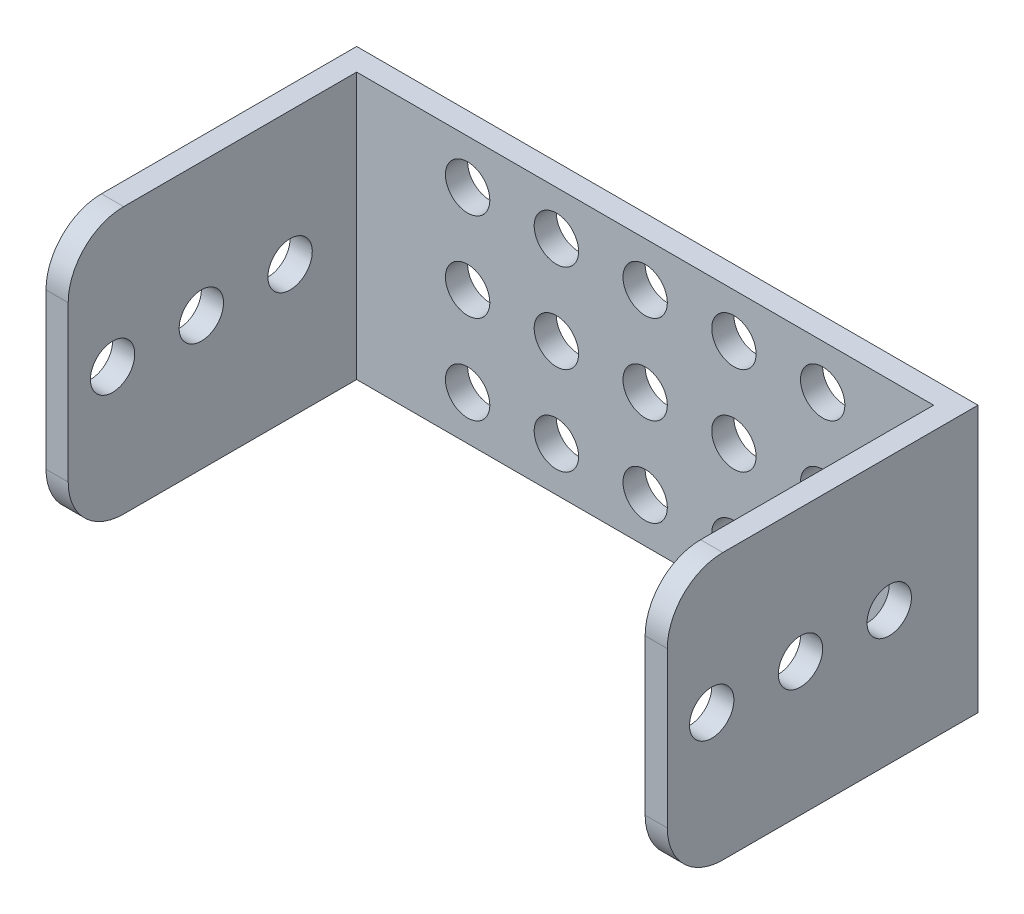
ISO-10303-21;
HEADER;
FILE_DESCRIPTION(('STEP AP214'),'2;1');
FILE_NAME('part.step','',(''),(''),'','','');
FILE_SCHEMA(('AUTOMOTIVE_DESIGN { 1 0 10303 214 1 1 1 1 }'));
ENDSEC;
DATA;
#1=APPLICATION_CONTEXT('core data for automotive mechanical design processes');
#2=APPLICATION_PROTOCOL_DEFINITION('international standard','automotive_design',2000,#1);
#3=PRODUCT_CONTEXT('',#1,'mechanical');
#4=PRODUCT('Part','Part','',(#3));
#5=PRODUCT_RELATED_PRODUCT_CATEGORY('part','',(#4));
#6=PRODUCT_DEFINITION_FORMATION('','',#4);
#7=PRODUCT_DEFINITION_CONTEXT('part definition',#1,'design');
#8=PRODUCT_DEFINITION('design','',#6,#7);
#9=PRODUCT_DEFINITION_SHAPE('','',#8);
#10=(LENGTH_UNIT() NAMED_UNIT(*) SI_UNIT(.MILLI.,.METRE.));
#11=(NAMED_UNIT(*) PLANE_ANGLE_UNIT() SI_UNIT($,.RADIAN.));
#12=(NAMED_UNIT(*) SI_UNIT($,.STERADIAN.) SOLID_ANGLE_UNIT());
#13=UNCERTAINTY_MEASURE_WITH_UNIT(LENGTH_MEASURE(1.E-05),#10,'distance_accuracy_value','');
#14=(GEOMETRIC_REPRESENTATION_CONTEXT(3) GLOBAL_UNCERTAINTY_ASSIGNED_CONTEXT((#13)) GLOBAL_UNIT_ASSIGNED_CONTEXT((#10,
#11,#12)) REPRESENTATION_CONTEXT('',''));
#15=CARTESIAN_POINT('',(0.,0.,0.));
#16=DIRECTION('',(0.,0.,1.));
#17=DIRECTION('',(1.,0.,0.));
#18=AXIS2_PLACEMENT_3D('',#15,#16,#17);
#19=CARTESIAN_POINT('',(0.,0.,2.));
#20=DIRECTION('',(0.,0.,1.));
#21=DIRECTION('',(1.,0.,0.));
#22=AXIS2_PLACEMENT_3D('',#19,#20,#21);
#23=PLANE('',#22);
#24=CARTESIAN_POINT('',(-8.,0.,2.));
#25=DIRECTION('',(0.,0.,1.));
#26=DIRECTION('',(1.,0.,0.));
#27=AXIS2_PLACEMENT_3D('',#24,#25,#26);
#28=CIRCLE('',#27,2.);
#29=CARTESIAN_POINT('',(-6.,0.,2.));
#30=VERTEX_POINT('',#29);
#31=EDGE_CURVE('E280',#30,#30,#28,.T.);
#32=ORIENTED_EDGE('',*,*,#31,.F.);
#33=EDGE_LOOP('',(#32));
#34=FACE_BOUND('',#33,.T.);
#35=CARTESIAN_POINT('',(-8.,-8.,2.));
#36=DIRECTION('',(0.,0.,1.));
#37=DIRECTION('',(1.,0.,0.));
#38=AXIS2_PLACEMENT_3D('',#35,#36,#37);
#39=CIRCLE('',#38,2.);
#40=CARTESIAN_POINT('',(-6.,-8.,2.));
#41=VERTEX_POINT('',#40);
#42=EDGE_CURVE('E286',#41,#41,#39,.T.);
#43=ORIENTED_EDGE('',*,*,#42,.F.);
#44=EDGE_LOOP('',(#43));
#45=FACE_BOUND('',#44,.T.);
#46=CARTESIAN_POINT('',(-8.,8.,2.));
#47=DIRECTION('',(0.,0.,1.));
#48=DIRECTION('',(1.,0.,0.));
#49=AXIS2_PLACEMENT_3D('',#46,#47,#48);
#50=CIRCLE('',#49,2.);
#51=CARTESIAN_POINT('',(-6.,8.,2.));
#52=VERTEX_POINT('',#51);
#53=EDGE_CURVE('E292',#52,#52,#50,.T.);
#54=ORIENTED_EDGE('',*,*,#53,.F.);
#55=EDGE_LOOP('',(#54));
#56=FACE_BOUND('',#55,.T.);
#57=CARTESIAN_POINT('',(8.,0.,2.));
#58=DIRECTION('',(0.,0.,1.));
#59=DIRECTION('',(1.,0.,0.));
#60=AXIS2_PLACEMENT_3D('',#57,#58,#59);
#61=CIRCLE('',#60,2.);
#62=CARTESIAN_POINT('',(10.,0.,2.));
#63=VERTEX_POINT('',#62);
#64=EDGE_CURVE('E298',#63,#63,#61,.T.);
#65=ORIENTED_EDGE('',*,*,#64,.F.);
#66=EDGE_LOOP('',(#65));
#67=FACE_BOUND('',#66,.T.);
#68=CARTESIAN_POINT('',(8.,-8.,2.));
#69=DIRECTION('',(0.,0.,1.));
#70=DIRECTION('',(1.,0.,0.));
#71=AXIS2_PLACEMENT_3D('',#68,#69,#70);
#72=CIRCLE('',#71,2.);
#73=CARTESIAN_POINT('',(10.,-8.,2.));
#74=VERTEX_POINT('',#73);
#75=EDGE_CURVE('E304',#74,#74,#72,.T.);
#76=ORIENTED_EDGE('',*,*,#75,.F.);
#77=EDGE_LOOP('',(#76));
#78=FACE_BOUND('',#77,.T.);
#79=CARTESIAN_POINT('',(8.,8.,2.));
#80=DIRECTION('',(0.,0.,1.));
#81=DIRECTION('',(1.,0.,0.));
#82=AXIS2_PLACEMENT_3D('',#79,#80,#81);
#83=CIRCLE('',#82,2.);
#84=CARTESIAN_POINT('',(10.,8.,2.));
#85=VERTEX_POINT('',#84);
#86=EDGE_CURVE('E310',#85,#85,#83,.T.);
#87=ORIENTED_EDGE('',*,*,#86,.F.);
#88=EDGE_LOOP('',(#87));
#89=FACE_BOUND('',#88,.T.);
#90=CARTESIAN_POINT('',(0.,8.,2.));
#91=DIRECTION('',(0.,0.,1.));
#92=DIRECTION('',(1.,0.,0.));
#93=AXIS2_PLACEMENT_3D('',#90,#91,#92);
#94=CIRCLE('',#93,2.);
#95=CARTESIAN_POINT('',(2.,8.,2.));
#96=VERTEX_POINT('',#95);
#97=EDGE_CURVE('E313',#96,#96,#94,.T.);
#98=ORIENTED_EDGE('',*,*,#97,.F.);
#99=EDGE_LOOP('',(#98));
#100=FACE_BOUND('',#99,.T.);
#101=CARTESIAN_POINT('',(0.,0.,2.));
#102=DIRECTION('',(0.,0.,1.));
#103=DIRECTION('',(1.,0.,0.));
#104=AXIS2_PLACEMENT_3D('',#101,#102,#103);
#105=CIRCLE('',#104,2.);
#106=CARTESIAN_POINT('',(2.,0.,2.));
#107=VERTEX_POINT('',#106);
#108=EDGE_CURVE('E319',#107,#107,#105,.T.);
#109=ORIENTED_EDGE('',*,*,#108,.F.);
#110=EDGE_LOOP('',(#109));
#111=FACE_BOUND('',#110,.T.);
#112=CARTESIAN_POINT('',(0.,-8.,2.));
#113=DIRECTION('',(0.,0.,1.));
#114=DIRECTION('',(1.,0.,0.));
#115=AXIS2_PLACEMENT_3D('',#112,#113,#114);
#116=CIRCLE('',#115,2.);
#117=CARTESIAN_POINT('',(2.,-8.,2.));
#118=VERTEX_POINT('',#117);
#119=EDGE_CURVE('E325',#118,#118,#116,.T.);
#120=ORIENTED_EDGE('',*,*,#119,.F.);
#121=EDGE_LOOP('',(#120));
#122=FACE_BOUND('',#121,.T.);
#123=DIRECTION('',(1.,0.,0.));
#124=VECTOR('',#123,1.);
#125=CARTESIAN_POINT('',(-28.,-12.,2.));
#126=LINE('',#125,#124);
#127=CARTESIAN_POINT('',(-26.,-12.,2.));
#128=VERTEX_POINT('',#127);
#129=CARTESIAN_POINT('',(26.,-12.,2.));
#130=VERTEX_POINT('',#129);
#131=EDGE_CURVE('E148',#128,#130,#126,.T.);
#132=ORIENTED_EDGE('',*,*,#131,.T.);
#133=DIRECTION('',(0.,-1.,0.));
#134=VECTOR('',#133,1.);
#135=CARTESIAN_POINT('',(26.,12.,2.));
#136=LINE('',#135,#134);
#137=CARTESIAN_POINT('',(26.,12.,2.));
#138=VERTEX_POINT('',#137);
#139=EDGE_CURVE('E147',#138,#130,#136,.T.);
#140=ORIENTED_EDGE('',*,*,#139,.F.);
#141=DIRECTION('',(-1.,0.,0.));
#142=VECTOR('',#141,1.);
#143=CARTESIAN_POINT('',(-28.,12.,2.));
#144=LINE('',#143,#142);
#145=CARTESIAN_POINT('',(-26.,12.,2.));
#146=VERTEX_POINT('',#145);
#147=EDGE_CURVE('E131',#138,#146,#144,.T.);
#148=ORIENTED_EDGE('',*,*,#147,.T.);
#149=DIRECTION('',(0.,1.,0.));
#150=VECTOR('',#149,1.);
#151=CARTESIAN_POINT('',(-26.,12.,2.));
#152=LINE('',#151,#150);
#153=EDGE_CURVE('E144',#128,#146,#152,.T.);
#154=ORIENTED_EDGE('',*,*,#153,.F.);
#155=EDGE_LOOP('',(#132,#140,#148,#154));
#156=FACE_BOUND('',#155,.T.);
#157=CARTESIAN_POINT('',(16.,8.,2.));
#158=DIRECTION('',(0.,0.,1.));
#159=DIRECTION('',(1.,0.,0.));
#160=AXIS2_PLACEMENT_3D('',#157,#158,#159);
#161=CIRCLE('',#160,2.);
#162=CARTESIAN_POINT('',(18.,8.,2.));
#163=VERTEX_POINT('',#162);
#164=EDGE_CURVE('E186',#163,#163,#161,.T.);
#165=ORIENTED_EDGE('',*,*,#164,.F.);
#166=EDGE_LOOP('',(#165));
#167=FACE_BOUND('',#166,.T.);
#168=CARTESIAN_POINT('',(16.,-8.,2.));
#169=DIRECTION('',(0.,0.,1.));
#170=DIRECTION('',(1.,0.,0.));
#171=AXIS2_PLACEMENT_3D('',#168,#169,#170);
#172=CIRCLE('',#171,2.);
#173=CARTESIAN_POINT('',(18.,-8.,2.));
#174=VERTEX_POINT('',#173);
#175=EDGE_CURVE('E192',#174,#174,#172,.T.);
#176=ORIENTED_EDGE('',*,*,#175,.F.);
#177=EDGE_LOOP('',(#176));
#178=FACE_BOUND('',#177,.T.);
#179=CARTESIAN_POINT('',(16.,0.,2.));
#180=DIRECTION('',(0.,0.,1.));
#181=DIRECTION('',(1.,0.,0.));
#182=AXIS2_PLACEMENT_3D('',#179,#180,#181);
#183=CIRCLE('',#182,2.);
#184=CARTESIAN_POINT('',(18.,0.,2.));
#185=VERTEX_POINT('',#184);
#186=EDGE_CURVE('E198',#185,#185,#183,.T.);
#187=ORIENTED_EDGE('',*,*,#186,.F.);
#188=EDGE_LOOP('',(#187));
#189=FACE_BOUND('',#188,.T.);
#190=CARTESIAN_POINT('',(-16.,8.,2.));
#191=DIRECTION('',(0.,0.,1.));
#192=DIRECTION('',(1.,0.,0.));
#193=AXIS2_PLACEMENT_3D('',#190,#191,#192);
#194=CIRCLE('',#193,2.);
#195=CARTESIAN_POINT('',(-14.,8.,2.));
#196=VERTEX_POINT('',#195);
#197=EDGE_CURVE('E204',#196,#196,#194,.T.);
#198=ORIENTED_EDGE('',*,*,#197,.F.);
#199=EDGE_LOOP('',(#198));
#200=FACE_BOUND('',#199,.T.);
#201=CARTESIAN_POINT('',(-16.,-8.,2.));
#202=DIRECTION('',(0.,0.,1.));
#203=DIRECTION('',(1.,0.,0.));
#204=AXIS2_PLACEMENT_3D('',#201,#202,#203);
#205=CIRCLE('',#204,2.);
#206=CARTESIAN_POINT('',(-14.,-8.,2.));
#207=VERTEX_POINT('',#206);
#208=EDGE_CURVE('E210',#207,#207,#205,.T.);
#209=ORIENTED_EDGE('',*,*,#208,.F.);
#210=EDGE_LOOP('',(#209));
#211=FACE_BOUND('',#210,.T.);
#212=CARTESIAN_POINT('',(-16.,0.,2.));
#213=DIRECTION('',(0.,0.,1.));
#214=DIRECTION('',(1.,0.,0.));
#215=AXIS2_PLACEMENT_3D('',#212,#213,#214);
#216=CIRCLE('',#215,2.);
#217=CARTESIAN_POINT('',(-14.,0.,2.));
#218=VERTEX_POINT('',#217);
#219=EDGE_CURVE('E216',#218,#218,#216,.T.);
#220=ORIENTED_EDGE('',*,*,#219,.F.);
#221=EDGE_LOOP('',(#220));
#222=FACE_BOUND('',#221,.T.);
#223=ADVANCED_FACE('F35',(#34,#45,#56,#67,#78,#89,#100,#111,#122,#156,#167,#178,#189,#200,#211,
#222),#23,.T.);
#224=CARTESIAN_POINT('',(28.,12.,2.));
#225=DIRECTION('',(-1.,0.,0.));
#226=DIRECTION('',(0.,-1.,0.));
#227=AXIS2_PLACEMENT_3D('',#224,#225,#226);
#228=PLANE('',#227);
#229=CARTESIAN_POINT('',(28.,0.,24.));
#230=DIRECTION('',(-1.,0.,0.));
#231=DIRECTION('',(0.,0.,1.));
#232=AXIS2_PLACEMENT_3D('',#229,#230,#231);
#233=CIRCLE('',#232,1.99999999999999);
#234=CARTESIAN_POINT('',(28.,0.,26.));
#235=VERTEX_POINT('',#234);
#236=EDGE_CURVE('E769',#235,#235,#233,.T.);
#237=ORIENTED_EDGE('',*,*,#236,.T.);
#238=EDGE_LOOP('',(#237));
#239=FACE_BOUND('',#238,.T.);
#240=CARTESIAN_POINT('',(28.,0.,16.));
#241=DIRECTION('',(-1.,0.,0.));
#242=DIRECTION('',(0.,0.,1.));
#243=AXIS2_PLACEMENT_3D('',#240,#241,#242);
#244=CIRCLE('',#243,1.99999999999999);
#245=CARTESIAN_POINT('',(28.,0.,18.));
#246=VERTEX_POINT('',#245);
#247=EDGE_CURVE('E255',#246,#246,#244,.T.);
#248=ORIENTED_EDGE('',*,*,#247,.T.);
#249=EDGE_LOOP('',(#248));
#250=FACE_BOUND('',#249,.T.);
#251=CARTESIAN_POINT('',(28.,0.,8.));
#252=DIRECTION('',(-1.,0.,0.));
#253=DIRECTION('',(0.,0.,1.));
#254=AXIS2_PLACEMENT_3D('',#251,#252,#253);
#255=CIRCLE('',#254,1.99999999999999);
#256=CARTESIAN_POINT('',(28.,0.,9.99999999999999));
#257=VERTEX_POINT('',#256);
#258=EDGE_CURVE('E251',#257,#257,#255,.T.);
#259=ORIENTED_EDGE('',*,*,#258,.T.);
#260=EDGE_LOOP('',(#259));
#261=FACE_BOUND('',#260,.T.);
#262=DIRECTION('',(0.,1.,0.));
#263=VECTOR('',#262,1.);
#264=CARTESIAN_POINT('',(28.,12.,28.));
#265=LINE('',#264,#263);
#266=CARTESIAN_POINT('',(28.,-6.99999999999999,28.));
#267=VERTEX_POINT('',#266);
#268=CARTESIAN_POINT('',(28.,7.00000000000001,28.));
#269=VERTEX_POINT('',#268);
#270=EDGE_CURVE('E331',#267,#269,#265,.T.);
#271=ORIENTED_EDGE('',*,*,#270,.F.);
#272=CARTESIAN_POINT('',(28.,-6.99999999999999,23.));
#273=DIRECTION('',(-1.,0.,0.));
#274=DIRECTION('',(0.,-1.,0.));
#275=AXIS2_PLACEMENT_3D('',#272,#273,#274);
#276=CIRCLE('',#275,5.);
#277=CARTESIAN_POINT('',(28.,-12.,23.));
#278=VERTEX_POINT('',#277);
#279=EDGE_CURVE('E227',#267,#278,#276,.F.);
#280=ORIENTED_EDGE('',*,*,#279,.T.);
#281=DIRECTION('',(0.,0.,-1.));
#282=VECTOR('',#281,1.);
#283=CARTESIAN_POINT('',(28.,-12.,2.));
#284=LINE('',#283,#282);
#285=CARTESIAN_POINT('',(28.,-12.,0.));
#286=VERTEX_POINT('',#285);
#287=EDGE_CURVE('E165',#278,#286,#284,.T.);
#288=ORIENTED_EDGE('',*,*,#287,.T.);
#289=DIRECTION('',(0.,1.,0.));
#290=VECTOR('',#289,1.);
#291=CARTESIAN_POINT('',(28.,12.,0.));
#292=LINE('',#291,#290);
#293=CARTESIAN_POINT('',(28.,12.,0.));
#294=VERTEX_POINT('',#293);
#295=EDGE_CURVE('E162',#286,#294,#292,.T.);
#296=ORIENTED_EDGE('',*,*,#295,.T.);
#297=DIRECTION('',(0.,0.,-1.));
#298=VECTOR('',#297,1.);
#299=CARTESIAN_POINT('',(28.,12.,2.));
#300=LINE('',#299,#298);
#301=CARTESIAN_POINT('',(28.,12.,23.));
#302=VERTEX_POINT('',#301);
#303=EDGE_CURVE('E181',#302,#294,#300,.T.);
#304=ORIENTED_EDGE('',*,*,#303,.F.);
#305=CARTESIAN_POINT('',(28.,7.00000000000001,23.));
#306=DIRECTION('',(-1.,0.,0.));
#307=DIRECTION('',(0.,-1.,0.));
#308=AXIS2_PLACEMENT_3D('',#305,#306,#307);
#309=CIRCLE('',#308,5.);
#310=EDGE_CURVE('E225',#302,#269,#309,.F.);
#311=ORIENTED_EDGE('',*,*,#310,.T.);
#312=EDGE_LOOP('',(#271,#280,#288,#296,#304,#311));
#313=FACE_BOUND('',#312,.T.);
#314=ADVANCED_FACE('F355',(#239,#250,#261,#313),#228,.F.);
#315=CARTESIAN_POINT('',(-28.,12.,2.));
#316=DIRECTION('',(0.,-1.,0.));
#317=DIRECTION('',(0.,0.,-1.));
#318=AXIS2_PLACEMENT_3D('',#315,#316,#317);
#319=PLANE('',#318);
#320=DIRECTION('',(0.,0.,-1.));
#321=VECTOR('',#320,1.);
#322=CARTESIAN_POINT('',(26.,12.,28.));
#323=LINE('',#322,#321);
#324=CARTESIAN_POINT('',(26.,12.,23.));
#325=VERTEX_POINT('',#324);
#326=EDGE_CURVE('E154',#325,#138,#323,.T.);
#327=ORIENTED_EDGE('',*,*,#326,.F.);
#328=DIRECTION('',(-1.,0.,0.));
#329=VECTOR('',#328,1.);
#330=CARTESIAN_POINT('',(-28.,12.,23.));
#331=LINE('',#330,#329);
#332=EDGE_CURVE('E238',#325,#302,#331,.F.);
#333=ORIENTED_EDGE('',*,*,#332,.T.);
#334=ORIENTED_EDGE('',*,*,#303,.T.);
#335=DIRECTION('',(-1.,0.,0.));
#336=VECTOR('',#335,1.);
#337=CARTESIAN_POINT('',(-28.,12.,0.));
#338=LINE('',#337,#336);
#339=CARTESIAN_POINT('',(-28.,12.,0.));
#340=VERTEX_POINT('',#339);
#341=EDGE_CURVE('E168',#294,#340,#338,.T.);
#342=ORIENTED_EDGE('',*,*,#341,.T.);
#343=DIRECTION('',(0.,0.,-1.));
#344=VECTOR('',#343,1.);
#345=CARTESIAN_POINT('',(-28.,12.,2.));
#346=LINE('',#345,#344);
#347=CARTESIAN_POINT('',(-28.,12.,23.));
#348=VERTEX_POINT('',#347);
#349=EDGE_CURVE('E179',#348,#340,#346,.T.);
#350=ORIENTED_EDGE('',*,*,#349,.F.);
#351=DIRECTION('',(-1.,0.,0.));
#352=VECTOR('',#351,1.);
#353=CARTESIAN_POINT('',(-26.,12.,23.));
#354=LINE('',#353,#352);
#355=CARTESIAN_POINT('',(-26.,12.,23.));
#356=VERTEX_POINT('',#355);
#357=EDGE_CURVE('E134',#348,#356,#354,.F.);
#358=ORIENTED_EDGE('',*,*,#357,.T.);
#359=DIRECTION('',(0.,0.,-1.));
#360=VECTOR('',#359,1.);
#361=CARTESIAN_POINT('',(-26.,12.,28.));
#362=LINE('',#361,#360);
#363=EDGE_CURVE('E127',#356,#146,#362,.T.);
#364=ORIENTED_EDGE('',*,*,#363,.T.);
#365=ORIENTED_EDGE('',*,*,#147,.F.);
#366=EDGE_LOOP('',(#327,#333,#334,#342,#350,#358,#364,#365));
#367=FACE_BOUND('',#366,.T.);
#368=ADVANCED_FACE('F130',(#367),#319,.F.);
#369=CARTESIAN_POINT('',(-28.,12.,2.));
#370=DIRECTION('',(1.,0.,0.));
#371=DIRECTION('',(0.,1.,0.));
#372=AXIS2_PLACEMENT_3D('',#369,#370,#371);
#373=PLANE('',#372);
#374=CARTESIAN_POINT('',(-28.,0.,24.));
#375=DIRECTION('',(-1.,0.,0.));
#376=DIRECTION('',(0.,0.,1.));
#377=AXIS2_PLACEMENT_3D('',#374,#375,#376);
#378=CIRCLE('',#377,1.99999999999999);
#379=CARTESIAN_POINT('',(-28.,0.,26.));
#380=VERTEX_POINT('',#379);
#381=EDGE_CURVE('E765',#380,#380,#378,.T.);
#382=ORIENTED_EDGE('',*,*,#381,.F.);
#383=EDGE_LOOP('',(#382));
#384=FACE_BOUND('',#383,.T.);
#385=CARTESIAN_POINT('',(-28.,0.,16.));
#386=DIRECTION('',(-1.,0.,0.));
#387=DIRECTION('',(0.,0.,1.));
#388=AXIS2_PLACEMENT_3D('',#385,#386,#387);
#389=CIRCLE('',#388,1.99999999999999);
#390=CARTESIAN_POINT('',(-28.,0.,18.));
#391=VERTEX_POINT('',#390);
#392=EDGE_CURVE('E262',#391,#391,#389,.T.);
#393=ORIENTED_EDGE('',*,*,#392,.F.);
#394=EDGE_LOOP('',(#393));
#395=FACE_BOUND('',#394,.T.);
#396=CARTESIAN_POINT('',(-28.,0.,8.));
#397=DIRECTION('',(-1.,0.,0.));
#398=DIRECTION('',(0.,0.,1.));
#399=AXIS2_PLACEMENT_3D('',#396,#397,#398);
#400=CIRCLE('',#399,1.99999999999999);
#401=CARTESIAN_POINT('',(-28.,0.,9.99999999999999));
#402=VERTEX_POINT('',#401);
#403=EDGE_CURVE('E259',#402,#402,#400,.T.);
#404=ORIENTED_EDGE('',*,*,#403,.F.);
#405=EDGE_LOOP('',(#404));
#406=FACE_BOUND('',#405,.T.);
#407=DIRECTION('',(0.,0.,-1.));
#408=VECTOR('',#407,1.);
#409=CARTESIAN_POINT('',(-28.,-12.,2.));
#410=LINE('',#409,#408);
#411=CARTESIAN_POINT('',(-28.,-12.,23.));
#412=VERTEX_POINT('',#411);
#413=CARTESIAN_POINT('',(-28.,-12.,0.));
#414=VERTEX_POINT('',#413);
#415=EDGE_CURVE('E177',#412,#414,#410,.T.);
#416=ORIENTED_EDGE('',*,*,#415,.F.);
#417=CARTESIAN_POINT('',(-28.,-6.99999999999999,23.));
#418=DIRECTION('',(1.,0.,0.));
#419=DIRECTION('',(0.,1.,0.));
#420=AXIS2_PLACEMENT_3D('',#417,#418,#419);
#421=CIRCLE('',#420,5.);
#422=CARTESIAN_POINT('',(-28.,-6.99999999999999,28.));
#423=VERTEX_POINT('',#422);
#424=EDGE_CURVE('E11',#412,#423,#421,.F.);
#425=ORIENTED_EDGE('',*,*,#424,.T.);
#426=DIRECTION('',(0.,-1.,0.));
#427=VECTOR('',#426,1.);
#428=CARTESIAN_POINT('',(-28.,12.,28.));
#429=LINE('',#428,#427);
#430=CARTESIAN_POINT('',(-28.,7.00000000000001,28.));
#431=VERTEX_POINT('',#430);
#432=EDGE_CURVE('E153',#431,#423,#429,.T.);
#433=ORIENTED_EDGE('',*,*,#432,.F.);
#434=CARTESIAN_POINT('',(-28.,7.00000000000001,23.));
#435=DIRECTION('',(1.,0.,0.));
#436=DIRECTION('',(0.,1.,0.));
#437=AXIS2_PLACEMENT_3D('',#434,#435,#436);
#438=CIRCLE('',#437,5.);
#439=EDGE_CURVE('E44',#431,#348,#438,.F.);
#440=ORIENTED_EDGE('',*,*,#439,.T.);
#441=ORIENTED_EDGE('',*,*,#349,.T.);
#442=DIRECTION('',(0.,-1.,0.));
#443=VECTOR('',#442,1.);
#444=CARTESIAN_POINT('',(-28.,12.,0.));
#445=LINE('',#444,#443);
#446=EDGE_CURVE('E171',#340,#414,#445,.T.);
#447=ORIENTED_EDGE('',*,*,#446,.T.);
#448=EDGE_LOOP('',(#416,#425,#433,#440,#441,#447));
#449=FACE_BOUND('',#448,.T.);
#450=ADVANCED_FACE('F375',(#384,#395,#406,#449),#373,.F.);
#451=CARTESIAN_POINT('',(-28.,-12.,2.));
#452=DIRECTION('',(0.,1.,0.));
#453=DIRECTION('',(0.,0.,1.));
#454=AXIS2_PLACEMENT_3D('',#451,#452,#453);
#455=PLANE('',#454);
#456=ORIENTED_EDGE('',*,*,#287,.F.);
#457=DIRECTION('',(1.,0.,0.));
#458=VECTOR('',#457,1.);
#459=CARTESIAN_POINT('',(-28.,-12.,23.));
#460=LINE('',#459,#458);
#461=CARTESIAN_POINT('',(26.,-12.,23.));
#462=VERTEX_POINT('',#461);
#463=EDGE_CURVE('E231',#278,#462,#460,.F.);
#464=ORIENTED_EDGE('',*,*,#463,.T.);
#465=DIRECTION('',(0.,0.,-1.));
#466=VECTOR('',#465,1.);
#467=CARTESIAN_POINT('',(26.,-12.,28.));
#468=LINE('',#467,#466);
#469=EDGE_CURVE('E158',#462,#130,#468,.T.);
#470=ORIENTED_EDGE('',*,*,#469,.T.);
#471=ORIENTED_EDGE('',*,*,#131,.F.);
#472=DIRECTION('',(0.,0.,-1.));
#473=VECTOR('',#472,1.);
#474=CARTESIAN_POINT('',(-26.,-12.,28.));
#475=LINE('',#474,#473);
#476=CARTESIAN_POINT('',(-26.,-12.,23.));
#477=VERTEX_POINT('',#476);
#478=EDGE_CURVE('E136',#477,#128,#475,.T.);
#479=ORIENTED_EDGE('',*,*,#478,.F.);
#480=DIRECTION('',(1.,0.,0.));
#481=VECTOR('',#480,1.);
#482=CARTESIAN_POINT('',(-28.,-12.,23.));
#483=LINE('',#482,#481);
#484=EDGE_CURVE('E229',#477,#412,#483,.F.);
#485=ORIENTED_EDGE('',*,*,#484,.T.);
#486=ORIENTED_EDGE('',*,*,#415,.T.);
#487=DIRECTION('',(1.,0.,0.));
#488=VECTOR('',#487,1.);
#489=CARTESIAN_POINT('',(-28.,-12.,0.));
#490=LINE('',#489,#488);
#491=EDGE_CURVE('E149',#414,#286,#490,.T.);
#492=ORIENTED_EDGE('',*,*,#491,.T.);
#493=EDGE_LOOP('',(#456,#464,#470,#471,#479,#485,#486,#492));
#494=FACE_BOUND('',#493,.T.);
#495=ADVANCED_FACE('F341',(#494),#455,.F.);
#496=CARTESIAN_POINT('',(0.,0.,0.));
#497=DIRECTION('',(0.,0.,1.));
#498=DIRECTION('',(1.,0.,0.));
#499=AXIS2_PLACEMENT_3D('',#496,#497,#498);
#500=PLANE('',#499);
#501=CARTESIAN_POINT('',(-8.,0.,0.));
#502=DIRECTION('',(0.,0.,1.));
#503=DIRECTION('',(1.,0.,0.));
#504=AXIS2_PLACEMENT_3D('',#501,#502,#503);
#505=CIRCLE('',#504,2.);
#506=CARTESIAN_POINT('',(-6.,0.,0.));
#507=VERTEX_POINT('',#506);
#508=EDGE_CURVE('E277',#507,#507,#505,.T.);
#509=ORIENTED_EDGE('',*,*,#508,.T.);
#510=EDGE_LOOP('',(#509));
#511=FACE_BOUND('',#510,.T.);
#512=CARTESIAN_POINT('',(-8.,-8.,0.));
#513=DIRECTION('',(0.,0.,1.));
#514=DIRECTION('',(1.,0.,0.));
#515=AXIS2_PLACEMENT_3D('',#512,#513,#514);
#516=CIRCLE('',#515,2.);
#517=CARTESIAN_POINT('',(-6.,-8.,0.));
#518=VERTEX_POINT('',#517);
#519=EDGE_CURVE('E283',#518,#518,#516,.T.);
#520=ORIENTED_EDGE('',*,*,#519,.T.);
#521=EDGE_LOOP('',(#520));
#522=FACE_BOUND('',#521,.T.);
#523=CARTESIAN_POINT('',(-8.,8.,0.));
#524=DIRECTION('',(0.,0.,1.));
#525=DIRECTION('',(1.,0.,0.));
#526=AXIS2_PLACEMENT_3D('',#523,#524,#525);
#527=CIRCLE('',#526,2.);
#528=CARTESIAN_POINT('',(-6.,8.,0.));
#529=VERTEX_POINT('',#528);
#530=EDGE_CURVE('E289',#529,#529,#527,.T.);
#531=ORIENTED_EDGE('',*,*,#530,.T.);
#532=EDGE_LOOP('',(#531));
#533=FACE_BOUND('',#532,.T.);
#534=CARTESIAN_POINT('',(8.,0.,0.));
#535=DIRECTION('',(0.,0.,1.));
#536=DIRECTION('',(1.,0.,0.));
#537=AXIS2_PLACEMENT_3D('',#534,#535,#536);
#538=CIRCLE('',#537,2.);
#539=CARTESIAN_POINT('',(10.,0.,0.));
#540=VERTEX_POINT('',#539);
#541=EDGE_CURVE('E295',#540,#540,#538,.T.);
#542=ORIENTED_EDGE('',*,*,#541,.T.);
#543=EDGE_LOOP('',(#542));
#544=FACE_BOUND('',#543,.T.);
#545=CARTESIAN_POINT('',(8.,-8.,0.));
#546=DIRECTION('',(0.,0.,1.));
#547=DIRECTION('',(1.,0.,0.));
#548=AXIS2_PLACEMENT_3D('',#545,#546,#547);
#549=CIRCLE('',#548,2.);
#550=CARTESIAN_POINT('',(10.,-8.,0.));
#551=VERTEX_POINT('',#550);
#552=EDGE_CURVE('E301',#551,#551,#549,.T.);
#553=ORIENTED_EDGE('',*,*,#552,.T.);
#554=EDGE_LOOP('',(#553));
#555=FACE_BOUND('',#554,.T.);
#556=CARTESIAN_POINT('',(8.,8.,0.));
#557=DIRECTION('',(0.,0.,1.));
#558=DIRECTION('',(1.,0.,0.));
#559=AXIS2_PLACEMENT_3D('',#556,#557,#558);
#560=CIRCLE('',#559,2.);
#561=CARTESIAN_POINT('',(10.,8.,0.));
#562=VERTEX_POINT('',#561);
#563=EDGE_CURVE('E307',#562,#562,#560,.T.);
#564=ORIENTED_EDGE('',*,*,#563,.T.);
#565=EDGE_LOOP('',(#564));
#566=FACE_BOUND('',#565,.T.);
#567=CARTESIAN_POINT('',(0.,8.,0.));
#568=DIRECTION('',(0.,0.,1.));
#569=DIRECTION('',(1.,0.,0.));
#570=AXIS2_PLACEMENT_3D('',#567,#568,#569);
#571=CIRCLE('',#570,2.);
#572=CARTESIAN_POINT('',(2.,8.,0.));
#573=VERTEX_POINT('',#572);
#574=EDGE_CURVE('E316',#573,#573,#571,.T.);
#575=ORIENTED_EDGE('',*,*,#574,.T.);
#576=EDGE_LOOP('',(#575));
#577=FACE_BOUND('',#576,.T.);
#578=CARTESIAN_POINT('',(0.,0.,0.));
#579=DIRECTION('',(0.,0.,1.));
#580=DIRECTION('',(1.,0.,0.));
#581=AXIS2_PLACEMENT_3D('',#578,#579,#580);
#582=CIRCLE('',#581,2.);
#583=CARTESIAN_POINT('',(2.,0.,0.));
#584=VERTEX_POINT('',#583);
#585=EDGE_CURVE('E322',#584,#584,#582,.T.);
#586=ORIENTED_EDGE('',*,*,#585,.T.);
#587=EDGE_LOOP('',(#586));
#588=FACE_BOUND('',#587,.T.);
#589=CARTESIAN_POINT('',(0.,-8.,0.));
#590=DIRECTION('',(0.,0.,1.));
#591=DIRECTION('',(1.,0.,0.));
#592=AXIS2_PLACEMENT_3D('',#589,#590,#591);
#593=CIRCLE('',#592,2.);
#594=CARTESIAN_POINT('',(2.,-8.,0.));
#595=VERTEX_POINT('',#594);
#596=EDGE_CURVE('E328',#595,#595,#593,.T.);
#597=ORIENTED_EDGE('',*,*,#596,.T.);
#598=EDGE_LOOP('',(#597));
#599=FACE_BOUND('',#598,.T.);
#600=ORIENTED_EDGE('',*,*,#295,.F.);
#601=ORIENTED_EDGE('',*,*,#491,.F.);
#602=ORIENTED_EDGE('',*,*,#446,.F.);
#603=ORIENTED_EDGE('',*,*,#341,.F.);
#604=EDGE_LOOP('',(#600,#601,#602,#603));
#605=FACE_BOUND('',#604,.T.);
#606=CARTESIAN_POINT('',(16.,8.,0.));
#607=DIRECTION('',(0.,0.,1.));
#608=DIRECTION('',(1.,0.,0.));
#609=AXIS2_PLACEMENT_3D('',#606,#607,#608);
#610=CIRCLE('',#609,2.);
#611=CARTESIAN_POINT('',(18.,8.,0.));
#612=VERTEX_POINT('',#611);
#613=EDGE_CURVE('E183',#612,#612,#610,.T.);
#614=ORIENTED_EDGE('',*,*,#613,.T.);
#615=EDGE_LOOP('',(#614));
#616=FACE_BOUND('',#615,.T.);
#617=CARTESIAN_POINT('',(16.,-8.,0.));
#618=DIRECTION('',(0.,0.,1.));
#619=DIRECTION('',(1.,0.,0.));
#620=AXIS2_PLACEMENT_3D('',#617,#618,#619);
#621=CIRCLE('',#620,2.);
#622=CARTESIAN_POINT('',(18.,-8.,0.));
#623=VERTEX_POINT('',#622);
#624=EDGE_CURVE('E189',#623,#623,#621,.T.);
#625=ORIENTED_EDGE('',*,*,#624,.T.);
#626=EDGE_LOOP('',(#625));
#627=FACE_BOUND('',#626,.T.);
#628=CARTESIAN_POINT('',(16.,0.,0.));
#629=DIRECTION('',(0.,0.,1.));
#630=DIRECTION('',(1.,0.,0.));
#631=AXIS2_PLACEMENT_3D('',#628,#629,#630);
#632=CIRCLE('',#631,2.);
#633=CARTESIAN_POINT('',(18.,0.,0.));
#634=VERTEX_POINT('',#633);
#635=EDGE_CURVE('E195',#634,#634,#632,.T.);
#636=ORIENTED_EDGE('',*,*,#635,.T.);
#637=EDGE_LOOP('',(#636));
#638=FACE_BOUND('',#637,.T.);
#639=CARTESIAN_POINT('',(-16.,8.,0.));
#640=DIRECTION('',(0.,0.,1.));
#641=DIRECTION('',(1.,0.,0.));
#642=AXIS2_PLACEMENT_3D('',#639,#640,#641);
#643=CIRCLE('',#642,2.);
#644=CARTESIAN_POINT('',(-14.,8.,0.));
#645=VERTEX_POINT('',#644);
#646=EDGE_CURVE('E201',#645,#645,#643,.T.);
#647=ORIENTED_EDGE('',*,*,#646,.T.);
#648=EDGE_LOOP('',(#647));
#649=FACE_BOUND('',#648,.T.);
#650=CARTESIAN_POINT('',(-16.,-8.,0.));
#651=DIRECTION('',(0.,0.,1.));
#652=DIRECTION('',(1.,0.,0.));
#653=AXIS2_PLACEMENT_3D('',#650,#651,#652);
#654=CIRCLE('',#653,2.);
#655=CARTESIAN_POINT('',(-14.,-8.,0.));
#656=VERTEX_POINT('',#655);
#657=EDGE_CURVE('E207',#656,#656,#654,.T.);
#658=ORIENTED_EDGE('',*,*,#657,.T.);
#659=EDGE_LOOP('',(#658));
#660=FACE_BOUND('',#659,.T.);
#661=CARTESIAN_POINT('',(-16.,0.,0.));
#662=DIRECTION('',(0.,0.,1.));
#663=DIRECTION('',(1.,0.,0.));
#664=AXIS2_PLACEMENT_3D('',#661,#662,#663);
#665=CIRCLE('',#664,2.);
#666=CARTESIAN_POINT('',(-14.,0.,0.));
#667=VERTEX_POINT('',#666);
#668=EDGE_CURVE('E213',#667,#667,#665,.T.);
#669=ORIENTED_EDGE('',*,*,#668,.T.);
#670=EDGE_LOOP('',(#669));
#671=FACE_BOUND('',#670,.T.);
#672=ADVANCED_FACE('F367',(#511,#522,#533,#544,#555,#566,#577,#588,#599,#605,#616,#627,#638,
#649,#660,#671),#500,.F.);
#673=CARTESIAN_POINT('',(-26.,12.,28.));
#674=DIRECTION('',(-1.,0.,0.));
#675=DIRECTION('',(0.,-1.,0.));
#676=AXIS2_PLACEMENT_3D('',#673,#674,#675);
#677=PLANE('',#676);
#678=CARTESIAN_POINT('',(-26.,0.,24.));
#679=DIRECTION('',(-1.,0.,0.));
#680=DIRECTION('',(0.,-1.,0.));
#681=AXIS2_PLACEMENT_3D('',#678,#679,#680);
#682=CIRCLE('',#681,1.99999999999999);
#683=CARTESIAN_POINT('',(-26.,-1.99999999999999,24.));
#684=VERTEX_POINT('',#683);
#685=EDGE_CURVE('E267',#684,#684,#682,.T.);
#686=ORIENTED_EDGE('',*,*,#685,.T.);
#687=EDGE_LOOP('',(#686));
#688=FACE_BOUND('',#687,.T.);
#689=CARTESIAN_POINT('',(-26.,0.,16.));
#690=DIRECTION('',(-1.,0.,0.));
#691=DIRECTION('',(0.,-1.,0.));
#692=AXIS2_PLACEMENT_3D('',#689,#690,#691);
#693=CIRCLE('',#692,1.99999999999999);
#694=CARTESIAN_POINT('',(-26.,-1.99999999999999,16.));
#695=VERTEX_POINT('',#694);
#696=EDGE_CURVE('E254',#695,#695,#693,.T.);
#697=ORIENTED_EDGE('',*,*,#696,.T.);
#698=EDGE_LOOP('',(#697));
#699=FACE_BOUND('',#698,.T.);
#700=CARTESIAN_POINT('',(-26.,0.,8.));
#701=DIRECTION('',(-1.,0.,0.));
#702=DIRECTION('',(0.,-1.,0.));
#703=AXIS2_PLACEMENT_3D('',#700,#701,#702);
#704=CIRCLE('',#703,1.99999999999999);
#705=CARTESIAN_POINT('',(-26.,-1.99999999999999,8.));
#706=VERTEX_POINT('',#705);
#707=EDGE_CURVE('E250',#706,#706,#704,.T.);
#708=ORIENTED_EDGE('',*,*,#707,.T.);
#709=EDGE_LOOP('',(#708));
#710=FACE_BOUND('',#709,.T.);
#711=DIRECTION('',(0.,1.,0.));
#712=VECTOR('',#711,1.);
#713=CARTESIAN_POINT('',(-26.,12.,28.));
#714=LINE('',#713,#712);
#715=CARTESIAN_POINT('',(-26.,-6.99999999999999,28.));
#716=VERTEX_POINT('',#715);
#717=CARTESIAN_POINT('',(-26.,7.00000000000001,28.));
#718=VERTEX_POINT('',#717);
#719=EDGE_CURVE('E137',#716,#718,#714,.T.);
#720=ORIENTED_EDGE('',*,*,#719,.F.);
#721=CARTESIAN_POINT('',(-26.,-6.99999999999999,23.));
#722=DIRECTION('',(-1.,0.,0.));
#723=DIRECTION('',(0.,-1.,0.));
#724=AXIS2_PLACEMENT_3D('',#721,#722,#723);
#725=CIRCLE('',#724,5.);
#726=EDGE_CURVE('E60',#716,#477,#725,.F.);
#727=ORIENTED_EDGE('',*,*,#726,.T.);
#728=ORIENTED_EDGE('',*,*,#478,.T.);
#729=ORIENTED_EDGE('',*,*,#153,.T.);
#730=ORIENTED_EDGE('',*,*,#363,.F.);
#731=CARTESIAN_POINT('',(-26.,7.00000000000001,23.));
#732=DIRECTION('',(-1.,0.,0.));
#733=DIRECTION('',(0.,-1.,0.));
#734=AXIS2_PLACEMENT_3D('',#731,#732,#733);
#735=CIRCLE('',#734,5.);
#736=EDGE_CURVE('E52',#356,#718,#735,.F.);
#737=ORIENTED_EDGE('',*,*,#736,.T.);
#738=EDGE_LOOP('',(#720,#727,#728,#729,#730,#737));
#739=FACE_BOUND('',#738,.T.);
#740=ADVANCED_FACE('F151',(#688,#699,#710,#739),#677,.F.);
#741=CARTESIAN_POINT('',(0.,0.,28.));
#742=DIRECTION('',(0.,0.,1.));
#743=DIRECTION('',(1.,0.,0.));
#744=AXIS2_PLACEMENT_3D('',#741,#742,#743);
#745=PLANE('',#744);
#746=ORIENTED_EDGE('',*,*,#432,.T.);
#747=DIRECTION('',(1.,0.,0.));
#748=VECTOR('',#747,1.);
#749=CARTESIAN_POINT('',(-26.,-6.99999999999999,28.));
#750=LINE('',#749,#748);
#751=EDGE_CURVE('E243',#423,#716,#750,.T.);
#752=ORIENTED_EDGE('',*,*,#751,.T.);
#753=ORIENTED_EDGE('',*,*,#719,.T.);
#754=DIRECTION('',(-1.,0.,0.));
#755=VECTOR('',#754,1.);
#756=CARTESIAN_POINT('',(-28.,7.00000000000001,28.));
#757=LINE('',#756,#755);
#758=EDGE_CURVE('E240',#718,#431,#757,.T.);
#759=ORIENTED_EDGE('',*,*,#758,.T.);
#760=EDGE_LOOP('',(#746,#752,#753,#759));
#761=FACE_BOUND('',#760,.T.);
#762=ADVANCED_FACE('F374',(#761),#745,.T.);
#763=CARTESIAN_POINT('',(26.,12.,28.));
#764=DIRECTION('',(1.,0.,0.));
#765=DIRECTION('',(0.,0.,-1.));
#766=AXIS2_PLACEMENT_3D('',#763,#764,#765);
#767=PLANE('',#766);
#768=CARTESIAN_POINT('',(26.,0.,24.));
#769=DIRECTION('',(1.,0.,0.));
#770=DIRECTION('',(0.,0.,-1.));
#771=AXIS2_PLACEMENT_3D('',#768,#769,#770);
#772=CIRCLE('',#771,1.99999999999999);
#773=CARTESIAN_POINT('',(26.,0.,22.));
#774=VERTEX_POINT('',#773);
#775=EDGE_CURVE('E39',#774,#774,#772,.T.);
#776=ORIENTED_EDGE('',*,*,#775,.T.);
#777=EDGE_LOOP('',(#776));
#778=FACE_BOUND('',#777,.T.);
#779=CARTESIAN_POINT('',(26.,0.,16.));
#780=DIRECTION('',(1.,0.,0.));
#781=DIRECTION('',(0.,0.,-1.));
#782=AXIS2_PLACEMENT_3D('',#779,#780,#781);
#783=CIRCLE('',#782,1.99999999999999);
#784=CARTESIAN_POINT('',(26.,0.,14.));
#785=VERTEX_POINT('',#784);
#786=EDGE_CURVE('E252',#785,#785,#783,.T.);
#787=ORIENTED_EDGE('',*,*,#786,.T.);
#788=EDGE_LOOP('',(#787));
#789=FACE_BOUND('',#788,.T.);
#790=CARTESIAN_POINT('',(26.,0.,8.));
#791=DIRECTION('',(1.,0.,0.));
#792=DIRECTION('',(0.,0.,-1.));
#793=AXIS2_PLACEMENT_3D('',#790,#791,#792);
#794=CIRCLE('',#793,1.99999999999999);
#795=CARTESIAN_POINT('',(26.,0.,6.00000000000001));
#796=VERTEX_POINT('',#795);
#797=EDGE_CURVE('E248',#796,#796,#794,.T.);
#798=ORIENTED_EDGE('',*,*,#797,.T.);
#799=EDGE_LOOP('',(#798));
#800=FACE_BOUND('',#799,.T.);
#801=ORIENTED_EDGE('',*,*,#469,.F.);
#802=CARTESIAN_POINT('',(26.,-6.99999999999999,23.));
#803=DIRECTION('',(1.,0.,0.));
#804=DIRECTION('',(0.,0.,-1.));
#805=AXIS2_PLACEMENT_3D('',#802,#803,#804);
#806=CIRCLE('',#805,5.);
#807=CARTESIAN_POINT('',(26.,-6.99999999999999,28.));
#808=VERTEX_POINT('',#807);
#809=EDGE_CURVE('E235',#462,#808,#806,.F.);
#810=ORIENTED_EDGE('',*,*,#809,.T.);
#811=DIRECTION('',(0.,-1.,0.));
#812=VECTOR('',#811,1.);
#813=CARTESIAN_POINT('',(26.,12.,28.));
#814=LINE('',#813,#812);
#815=CARTESIAN_POINT('',(26.,7.00000000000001,28.));
#816=VERTEX_POINT('',#815);
#817=EDGE_CURVE('E334',#816,#808,#814,.T.);
#818=ORIENTED_EDGE('',*,*,#817,.F.);
#819=CARTESIAN_POINT('',(26.,7.00000000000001,23.));
#820=DIRECTION('',(1.,0.,0.));
#821=DIRECTION('',(0.,0.,-1.));
#822=AXIS2_PLACEMENT_3D('',#819,#820,#821);
#823=CIRCLE('',#822,5.);
#824=EDGE_CURVE('E233',#816,#325,#823,.F.);
#825=ORIENTED_EDGE('',*,*,#824,.T.);
#826=ORIENTED_EDGE('',*,*,#326,.T.);
#827=ORIENTED_EDGE('',*,*,#139,.T.);
#828=EDGE_LOOP('',(#801,#810,#818,#825,#826,#827));
#829=FACE_BOUND('',#828,.T.);
#830=ADVANCED_FACE('F345',(#778,#789,#800,#829),#767,.F.);
#831=CARTESIAN_POINT('',(0.,0.,28.));
#832=DIRECTION('',(0.,0.,-1.));
#833=DIRECTION('',(-1.,0.,0.));
#834=AXIS2_PLACEMENT_3D('',#831,#832,#833);
#835=PLANE('',#834);
#836=ORIENTED_EDGE('',*,*,#817,.T.);
#837=DIRECTION('',(1.,0.,0.));
#838=VECTOR('',#837,1.);
#839=CARTESIAN_POINT('',(0.,-6.99999999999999,28.));
#840=LINE('',#839,#838);
#841=EDGE_CURVE('E222',#808,#267,#840,.T.);
#842=ORIENTED_EDGE('',*,*,#841,.T.);
#843=ORIENTED_EDGE('',*,*,#270,.T.);
#844=DIRECTION('',(-1.,0.,0.));
#845=VECTOR('',#844,1.);
#846=CARTESIAN_POINT('',(0.,7.00000000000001,28.));
#847=LINE('',#846,#845);
#848=EDGE_CURVE('E219',#269,#816,#847,.T.);
#849=ORIENTED_EDGE('',*,*,#848,.T.);
#850=EDGE_LOOP('',(#836,#842,#843,#849));
#851=FACE_BOUND('',#850,.T.);
#852=ADVANCED_FACE('F357',(#851),#835,.F.);
#853=CARTESIAN_POINT('',(0.,-8.,2.));
#854=DIRECTION('',(0.,0.,1.));
#855=DIRECTION('',(1.,0.,0.));
#856=AXIS2_PLACEMENT_3D('',#853,#854,#855);
#857=CYLINDRICAL_SURFACE('',#856,2.);
#858=ORIENTED_EDGE('',*,*,#596,.F.);
#859=EDGE_LOOP('',(#858));
#860=FACE_BOUND('',#859,.T.);
#861=ORIENTED_EDGE('',*,*,#119,.T.);
#862=EDGE_LOOP('',(#861));
#863=FACE_BOUND('',#862,.T.);
#864=ADVANCED_FACE('F586',(#860,#863),#857,.F.);
#865=CARTESIAN_POINT('',(0.,0.,2.));
#866=DIRECTION('',(0.,0.,1.));
#867=DIRECTION('',(1.,0.,0.));
#868=AXIS2_PLACEMENT_3D('',#865,#866,#867);
#869=CYLINDRICAL_SURFACE('',#868,2.);
#870=ORIENTED_EDGE('',*,*,#585,.F.);
#871=EDGE_LOOP('',(#870));
#872=FACE_BOUND('',#871,.T.);
#873=ORIENTED_EDGE('',*,*,#108,.T.);
#874=EDGE_LOOP('',(#873));
#875=FACE_BOUND('',#874,.T.);
#876=ADVANCED_FACE('F582',(#872,#875),#869,.F.);
#877=CARTESIAN_POINT('',(0.,8.,2.));
#878=DIRECTION('',(0.,0.,1.));
#879=DIRECTION('',(1.,0.,0.));
#880=AXIS2_PLACEMENT_3D('',#877,#878,#879);
#881=CYLINDRICAL_SURFACE('',#880,2.);
#882=ORIENTED_EDGE('',*,*,#574,.F.);
#883=EDGE_LOOP('',(#882));
#884=FACE_BOUND('',#883,.T.);
#885=ORIENTED_EDGE('',*,*,#97,.T.);
#886=EDGE_LOOP('',(#885));
#887=FACE_BOUND('',#886,.T.);
#888=ADVANCED_FACE('F578',(#884,#887),#881,.F.);
#889=CARTESIAN_POINT('',(8.,8.,2.));
#890=DIRECTION('',(0.,0.,1.));
#891=DIRECTION('',(1.,0.,0.));
#892=AXIS2_PLACEMENT_3D('',#889,#890,#891);
#893=CYLINDRICAL_SURFACE('',#892,2.);
#894=ORIENTED_EDGE('',*,*,#563,.F.);
#895=EDGE_LOOP('',(#894));
#896=FACE_BOUND('',#895,.T.);
#897=ORIENTED_EDGE('',*,*,#86,.T.);
#898=EDGE_LOOP('',(#897));
#899=FACE_BOUND('',#898,.T.);
#900=ADVANCED_FACE('F412',(#896,#899),#893,.F.);
#901=CARTESIAN_POINT('',(16.,8.,2.));
#902=DIRECTION('',(0.,0.,1.));
#903=DIRECTION('',(1.,0.,0.));
#904=AXIS2_PLACEMENT_3D('',#901,#902,#903);
#905=CYLINDRICAL_SURFACE('',#904,2.);
#906=ORIENTED_EDGE('',*,*,#613,.F.);
#907=EDGE_LOOP('',(#906));
#908=FACE_BOUND('',#907,.T.);
#909=ORIENTED_EDGE('',*,*,#164,.T.);
#910=EDGE_LOOP('',(#909));
#911=FACE_BOUND('',#910,.T.);
#912=ADVANCED_FACE('F408',(#908,#911),#905,.F.);
#913=CARTESIAN_POINT('',(8.,-8.,2.));
#914=DIRECTION('',(0.,0.,1.));
#915=DIRECTION('',(1.,0.,0.));
#916=AXIS2_PLACEMENT_3D('',#913,#914,#915);
#917=CYLINDRICAL_SURFACE('',#916,2.);
#918=ORIENTED_EDGE('',*,*,#552,.F.);
#919=EDGE_LOOP('',(#918));
#920=FACE_BOUND('',#919,.T.);
#921=ORIENTED_EDGE('',*,*,#75,.T.);
#922=EDGE_LOOP('',(#921));
#923=FACE_BOUND('',#922,.T.);
#924=ADVANCED_FACE('F411',(#920,#923),#917,.F.);
#925=CARTESIAN_POINT('',(16.,-8.,2.));
#926=DIRECTION('',(0.,0.,1.));
#927=DIRECTION('',(1.,0.,0.));
#928=AXIS2_PLACEMENT_3D('',#925,#926,#927);
#929=CYLINDRICAL_SURFACE('',#928,2.);
#930=ORIENTED_EDGE('',*,*,#624,.F.);
#931=EDGE_LOOP('',(#930));
#932=FACE_BOUND('',#931,.T.);
#933=ORIENTED_EDGE('',*,*,#175,.T.);
#934=EDGE_LOOP('',(#933));
#935=FACE_BOUND('',#934,.T.);
#936=ADVANCED_FACE('F414',(#932,#935),#929,.F.);
#937=CARTESIAN_POINT('',(8.,0.,2.));
#938=DIRECTION('',(0.,0.,1.));
#939=DIRECTION('',(1.,0.,0.));
#940=AXIS2_PLACEMENT_3D('',#937,#938,#939);
#941=CYLINDRICAL_SURFACE('',#940,2.);
#942=ORIENTED_EDGE('',*,*,#541,.F.);
#943=EDGE_LOOP('',(#942));
#944=FACE_BOUND('',#943,.T.);
#945=ORIENTED_EDGE('',*,*,#64,.T.);
#946=EDGE_LOOP('',(#945));
#947=FACE_BOUND('',#946,.T.);
#948=ADVANCED_FACE('F417',(#944,#947),#941,.F.);
#949=CARTESIAN_POINT('',(16.,0.,2.));
#950=DIRECTION('',(0.,0.,1.));
#951=DIRECTION('',(1.,0.,0.));
#952=AXIS2_PLACEMENT_3D('',#949,#950,#951);
#953=CYLINDRICAL_SURFACE('',#952,2.);
#954=ORIENTED_EDGE('',*,*,#635,.F.);
#955=EDGE_LOOP('',(#954));
#956=FACE_BOUND('',#955,.T.);
#957=ORIENTED_EDGE('',*,*,#186,.T.);
#958=EDGE_LOOP('',(#957));
#959=FACE_BOUND('',#958,.T.);
#960=ADVANCED_FACE('F419',(#956,#959),#953,.F.);
#961=CARTESIAN_POINT('',(-8.,8.,2.));
#962=DIRECTION('',(0.,0.,1.));
#963=DIRECTION('',(1.,0.,0.));
#964=AXIS2_PLACEMENT_3D('',#961,#962,#963);
#965=CYLINDRICAL_SURFACE('',#964,2.);
#966=ORIENTED_EDGE('',*,*,#530,.F.);
#967=EDGE_LOOP('',(#966));
#968=FACE_BOUND('',#967,.T.);
#969=ORIENTED_EDGE('',*,*,#53,.T.);
#970=EDGE_LOOP('',(#969));
#971=FACE_BOUND('',#970,.T.);
#972=ADVANCED_FACE('F422',(#968,#971),#965,.F.);
#973=CARTESIAN_POINT('',(-16.,8.,2.));
#974=DIRECTION('',(0.,0.,1.));
#975=DIRECTION('',(1.,0.,0.));
#976=AXIS2_PLACEMENT_3D('',#973,#974,#975);
#977=CYLINDRICAL_SURFACE('',#976,2.);
#978=ORIENTED_EDGE('',*,*,#646,.F.);
#979=EDGE_LOOP('',(#978));
#980=FACE_BOUND('',#979,.T.);
#981=ORIENTED_EDGE('',*,*,#197,.T.);
#982=EDGE_LOOP('',(#981));
#983=FACE_BOUND('',#982,.T.);
#984=ADVANCED_FACE('F424',(#980,#983),#977,.F.);
#985=CARTESIAN_POINT('',(-8.,-8.,2.));
#986=DIRECTION('',(0.,0.,1.));
#987=DIRECTION('',(1.,0.,0.));
#988=AXIS2_PLACEMENT_3D('',#985,#986,#987);
#989=CYLINDRICAL_SURFACE('',#988,2.);
#990=ORIENTED_EDGE('',*,*,#519,.F.);
#991=EDGE_LOOP('',(#990));
#992=FACE_BOUND('',#991,.T.);
#993=ORIENTED_EDGE('',*,*,#42,.T.);
#994=EDGE_LOOP('',(#993));
#995=FACE_BOUND('',#994,.T.);
#996=ADVANCED_FACE('F427',(#992,#995),#989,.F.);
#997=CARTESIAN_POINT('',(-16.,-8.,2.));
#998=DIRECTION('',(0.,0.,1.));
#999=DIRECTION('',(1.,0.,0.));
#1000=AXIS2_PLACEMENT_3D('',#997,#998,#999);
#1001=CYLINDRICAL_SURFACE('',#1000,2.);
#1002=ORIENTED_EDGE('',*,*,#657,.F.);
#1003=EDGE_LOOP('',(#1002));
#1004=FACE_BOUND('',#1003,.T.);
#1005=ORIENTED_EDGE('',*,*,#208,.T.);
#1006=EDGE_LOOP('',(#1005));
#1007=FACE_BOUND('',#1006,.T.);
#1008=ADVANCED_FACE('F429',(#1004,#1007),#1001,.F.);
#1009=CARTESIAN_POINT('',(-8.,0.,2.));
#1010=DIRECTION('',(0.,0.,1.));
#1011=DIRECTION('',(1.,0.,0.));
#1012=AXIS2_PLACEMENT_3D('',#1009,#1010,#1011);
#1013=CYLINDRICAL_SURFACE('',#1012,2.);
#1014=ORIENTED_EDGE('',*,*,#508,.F.);
#1015=EDGE_LOOP('',(#1014));
#1016=FACE_BOUND('',#1015,.T.);
#1017=ORIENTED_EDGE('',*,*,#31,.T.);
#1018=EDGE_LOOP('',(#1017));
#1019=FACE_BOUND('',#1018,.T.);
#1020=ADVANCED_FACE('F432',(#1016,#1019),#1013,.F.);
#1021=CARTESIAN_POINT('',(-16.,0.,2.));
#1022=DIRECTION('',(0.,0.,1.));
#1023=DIRECTION('',(1.,0.,0.));
#1024=AXIS2_PLACEMENT_3D('',#1021,#1022,#1023);
#1025=CYLINDRICAL_SURFACE('',#1024,2.);
#1026=ORIENTED_EDGE('',*,*,#668,.F.);
#1027=EDGE_LOOP('',(#1026));
#1028=FACE_BOUND('',#1027,.T.);
#1029=ORIENTED_EDGE('',*,*,#219,.T.);
#1030=EDGE_LOOP('',(#1029));
#1031=FACE_BOUND('',#1030,.T.);
#1032=ADVANCED_FACE('F434',(#1028,#1031),#1025,.F.);
#1033=CARTESIAN_POINT('',(0.,-6.99999999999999,23.));
#1034=DIRECTION('',(1.,0.,0.));
#1035=DIRECTION('',(0.,0.,-1.));
#1036=AXIS2_PLACEMENT_3D('',#1033,#1034,#1035);
#1037=CYLINDRICAL_SURFACE('',#1036,5.);
#1038=ORIENTED_EDGE('',*,*,#809,.F.);
#1039=ORIENTED_EDGE('',*,*,#463,.F.);
#1040=ORIENTED_EDGE('',*,*,#279,.F.);
#1041=ORIENTED_EDGE('',*,*,#841,.F.);
#1042=EDGE_LOOP('',(#1038,#1039,#1040,#1041));
#1043=FACE_BOUND('',#1042,.T.);
#1044=ADVANCED_FACE('F360',(#1043),#1037,.T.);
#1045=CARTESIAN_POINT('',(0.,7.00000000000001,23.));
#1046=DIRECTION('',(-1.,0.,0.));
#1047=DIRECTION('',(0.,0.,1.));
#1048=AXIS2_PLACEMENT_3D('',#1045,#1046,#1047);
#1049=CYLINDRICAL_SURFACE('',#1048,5.);
#1050=ORIENTED_EDGE('',*,*,#310,.F.);
#1051=ORIENTED_EDGE('',*,*,#332,.F.);
#1052=ORIENTED_EDGE('',*,*,#824,.F.);
#1053=ORIENTED_EDGE('',*,*,#848,.F.);
#1054=EDGE_LOOP('',(#1050,#1051,#1052,#1053));
#1055=FACE_BOUND('',#1054,.T.);
#1056=ADVANCED_FACE('F351',(#1055),#1049,.T.);
#1057=CARTESIAN_POINT('',(0.,-6.99999999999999,23.));
#1058=DIRECTION('',(-1.,0.,0.));
#1059=DIRECTION('',(0.,0.,1.));
#1060=AXIS2_PLACEMENT_3D('',#1057,#1058,#1059);
#1061=CYLINDRICAL_SURFACE('',#1060,5.);
#1062=ORIENTED_EDGE('',*,*,#424,.F.);
#1063=ORIENTED_EDGE('',*,*,#484,.F.);
#1064=ORIENTED_EDGE('',*,*,#726,.F.);
#1065=ORIENTED_EDGE('',*,*,#751,.F.);
#1066=EDGE_LOOP('',(#1062,#1063,#1064,#1065));
#1067=FACE_BOUND('',#1066,.T.);
#1068=ADVANCED_FACE('F377',(#1067),#1061,.T.);
#1069=CARTESIAN_POINT('',(0.,7.00000000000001,23.));
#1070=DIRECTION('',(1.,0.,0.));
#1071=DIRECTION('',(0.,0.,-1.));
#1072=AXIS2_PLACEMENT_3D('',#1069,#1070,#1071);
#1073=CYLINDRICAL_SURFACE('',#1072,5.);
#1074=ORIENTED_EDGE('',*,*,#736,.F.);
#1075=ORIENTED_EDGE('',*,*,#357,.F.);
#1076=ORIENTED_EDGE('',*,*,#439,.F.);
#1077=ORIENTED_EDGE('',*,*,#758,.F.);
#1078=EDGE_LOOP('',(#1074,#1075,#1076,#1077));
#1079=FACE_BOUND('',#1078,.T.);
#1080=ADVANCED_FACE('F37',(#1079),#1073,.T.);
#1081=CARTESIAN_POINT('',(-28.,0.,8.));
#1082=DIRECTION('',(-1.,0.,0.));
#1083=DIRECTION('',(0.,0.,1.));
#1084=AXIS2_PLACEMENT_3D('',#1081,#1082,#1083);
#1085=CYLINDRICAL_SURFACE('',#1084,1.99999999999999);
#1086=ORIENTED_EDGE('',*,*,#258,.F.);
#1087=EDGE_LOOP('',(#1086));
#1088=FACE_BOUND('',#1087,.T.);
#1089=ORIENTED_EDGE('',*,*,#797,.F.);
#1090=EDGE_LOOP('',(#1089));
#1091=FACE_BOUND('',#1090,.T.);
#1092=ADVANCED_FACE('F383',(#1088,#1091),#1085,.F.);
#1093=ORIENTED_EDGE('',*,*,#403,.T.);
#1094=EDGE_LOOP('',(#1093));
#1095=FACE_BOUND('',#1094,.T.);
#1096=ORIENTED_EDGE('',*,*,#707,.F.);
#1097=EDGE_LOOP('',(#1096));
#1098=FACE_BOUND('',#1097,.T.);
#1099=ADVANCED_FACE('F508',(#1095,#1098),#1085,.F.);
#1100=CARTESIAN_POINT('',(-28.,0.,16.));
#1101=DIRECTION('',(-1.,0.,0.));
#1102=DIRECTION('',(0.,0.,1.));
#1103=AXIS2_PLACEMENT_3D('',#1100,#1101,#1102);
#1104=CYLINDRICAL_SURFACE('',#1103,1.99999999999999);
#1105=ORIENTED_EDGE('',*,*,#247,.F.);
#1106=EDGE_LOOP('',(#1105));
#1107=FACE_BOUND('',#1106,.T.);
#1108=ORIENTED_EDGE('',*,*,#786,.F.);
#1109=EDGE_LOOP('',(#1108));
#1110=FACE_BOUND('',#1109,.T.);
#1111=ADVANCED_FACE('F518',(#1107,#1110),#1104,.F.);
#1112=ORIENTED_EDGE('',*,*,#392,.T.);
#1113=EDGE_LOOP('',(#1112));
#1114=FACE_BOUND('',#1113,.T.);
#1115=ORIENTED_EDGE('',*,*,#696,.F.);
#1116=EDGE_LOOP('',(#1115));
#1117=FACE_BOUND('',#1116,.T.);
#1118=ADVANCED_FACE('F527',(#1114,#1117),#1104,.F.);
#1119=CARTESIAN_POINT('',(-28.,0.,24.));
#1120=DIRECTION('',(-1.,0.,0.));
#1121=DIRECTION('',(0.,0.,1.));
#1122=AXIS2_PLACEMENT_3D('',#1119,#1120,#1121);
#1123=CYLINDRICAL_SURFACE('',#1122,1.99999999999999);
#1124=ORIENTED_EDGE('',*,*,#236,.F.);
#1125=EDGE_LOOP('',(#1124));
#1126=FACE_BOUND('',#1125,.T.);
#1127=ORIENTED_EDGE('',*,*,#775,.F.);
#1128=EDGE_LOOP('',(#1127));
#1129=FACE_BOUND('',#1128,.T.);
#1130=ADVANCED_FACE('F537',(#1126,#1129),#1123,.F.);
#1131=ORIENTED_EDGE('',*,*,#381,.T.);
#1132=EDGE_LOOP('',(#1131));
#1133=FACE_BOUND('',#1132,.T.);
#1134=ORIENTED_EDGE('',*,*,#685,.F.);
#1135=EDGE_LOOP('',(#1134));
#1136=FACE_BOUND('',#1135,.T.);
#1137=ADVANCED_FACE('F546',(#1133,#1136),#1123,.F.);
#1138=CLOSED_SHELL('',(#223,#314,#368,#450,#495,#672,#740,#762,#830,#852,#864,#876,#888,#900,
#912,#924,#936,#948,#960,#972,#984,#996,#1008,#1020,#1032,#1044,#1056,#1068,#1080,#1092,#1099,
#1111,#1118,#1130,#1137));
#1139=MANIFOLD_SOLID_BREP('B2',#1138);
#1140=ADVANCED_BREP_SHAPE_REPRESENTATION('',(#18,#1139),#14);
#1141=SHAPE_DEFINITION_REPRESENTATION(#9,#1140);
ENDSEC;
END-ISO-10303-21;
